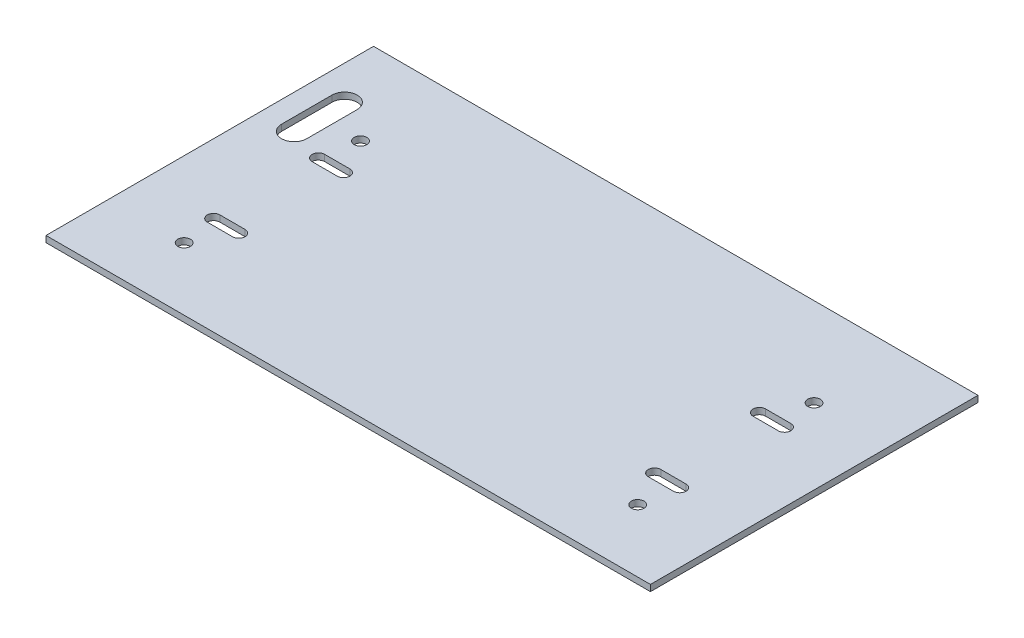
ISO-10303-21;
HEADER;
FILE_DESCRIPTION(('STEP AP214'),'2;1');
FILE_NAME('part.step','',(''),(''),'','','');
FILE_SCHEMA(('AUTOMOTIVE_DESIGN { 1 0 10303 214 1 1 1 1 }'));
ENDSEC;
DATA;
#1=APPLICATION_CONTEXT('core data for automotive mechanical design processes');
#2=APPLICATION_PROTOCOL_DEFINITION('international standard','automotive_design',2000,#1);
#3=PRODUCT_CONTEXT('',#1,'mechanical');
#4=PRODUCT('Part','Part','',(#3));
#5=PRODUCT_RELATED_PRODUCT_CATEGORY('part','',(#4));
#6=PRODUCT_DEFINITION_FORMATION('','',#4);
#7=PRODUCT_DEFINITION_CONTEXT('part definition',#1,'design');
#8=PRODUCT_DEFINITION('design','',#6,#7);
#9=PRODUCT_DEFINITION_SHAPE('','',#8);
#10=(LENGTH_UNIT() NAMED_UNIT(*) SI_UNIT(.MILLI.,.METRE.));
#11=(NAMED_UNIT(*) PLANE_ANGLE_UNIT() SI_UNIT($,.RADIAN.));
#12=(NAMED_UNIT(*) SI_UNIT($,.STERADIAN.) SOLID_ANGLE_UNIT());
#13=UNCERTAINTY_MEASURE_WITH_UNIT(LENGTH_MEASURE(1.E-05),#10,'distance_accuracy_value','');
#14=(GEOMETRIC_REPRESENTATION_CONTEXT(3) GLOBAL_UNCERTAINTY_ASSIGNED_CONTEXT((#13)) GLOBAL_UNIT_ASSIGNED_CONTEXT((#10,
#11,#12)) REPRESENTATION_CONTEXT('',''));
#15=CARTESIAN_POINT('',(0.,0.,0.));
#16=DIRECTION('',(0.,0.,1.));
#17=DIRECTION('',(1.,0.,0.));
#18=AXIS2_PLACEMENT_3D('',#15,#16,#17);
#19=CARTESIAN_POINT('',(0.,405.387122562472,-1.35788972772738E-13));
#20=DIRECTION('',(0.,-1.,0.));
#21=DIRECTION('',(0.,0.,-1.));
#22=AXIS2_PLACEMENT_3D('',#19,#20,#21);
#23=PLANE('',#22);
#24=DIRECTION('',(1.,0.,0.));
#25=VECTOR('',#24,1.);
#26=CARTESIAN_POINT('',(-877.346620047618,405.387122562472,1209.64459463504));
#27=LINE('',#26,#25);
#28=CARTESIAN_POINT('',(-877.346620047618,405.387122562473,1209.64459463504));
#29=VERTEX_POINT('',#28);
#30=CARTESIAN_POINT('',(-864.646620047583,405.387122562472,1209.64459463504));
#31=VERTEX_POINT('',#30);
#32=EDGE_CURVE('E260',#29,#31,#27,.T.);
#33=ORIENTED_EDGE('',*,*,#32,.F.);
#34=CARTESIAN_POINT('',(-877.346620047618,405.387122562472,1206.46959463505));
#35=DIRECTION('',(0.,1.,0.));
#36=DIRECTION('',(0.,0.,1.));
#37=AXIS2_PLACEMENT_3D('',#34,#35,#36);
#38=CIRCLE('',#37,3.17499999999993);
#39=CARTESIAN_POINT('',(-877.346620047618,405.387122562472,1203.29459463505));
#40=VERTEX_POINT('',#39);
#41=EDGE_CURVE('E53',#40,#29,#38,.T.);
#42=ORIENTED_EDGE('',*,*,#41,.F.);
#43=DIRECTION('',(-1.,0.,0.));
#44=VECTOR('',#43,1.);
#45=CARTESIAN_POINT('',(-877.346620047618,405.387122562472,1203.29459463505));
#46=LINE('',#45,#44);
#47=CARTESIAN_POINT('',(-864.646620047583,405.387122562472,1203.29459463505));
#48=VERTEX_POINT('',#47);
#49=EDGE_CURVE('E248',#48,#40,#46,.T.);
#50=ORIENTED_EDGE('',*,*,#49,.F.);
#51=CARTESIAN_POINT('',(-864.646620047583,405.387122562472,1206.46959463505));
#52=DIRECTION('',(0.,1.,0.));
#53=DIRECTION('',(0.,0.,1.));
#54=AXIS2_PLACEMENT_3D('',#51,#52,#53);
#55=CIRCLE('',#54,3.17499999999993);
#56=EDGE_CURVE('E251',#31,#48,#55,.T.);
#57=ORIENTED_EDGE('',*,*,#56,.F.);
#58=EDGE_LOOP('',(#33,#42,#50,#57));
#59=FACE_BOUND('',#58,.T.);
#60=DIRECTION('',(-1.,0.,0.));
#61=VECTOR('',#60,1.);
#62=CARTESIAN_POINT('',(-642.396620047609,405.387122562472,1150.46190980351));
#63=LINE('',#62,#61);
#64=CARTESIAN_POINT('',(-642.396620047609,405.387122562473,1150.46190980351));
#65=VERTEX_POINT('',#64);
#66=CARTESIAN_POINT('',(-655.096620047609,405.387122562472,1150.46190980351));
#67=VERTEX_POINT('',#66);
#68=EDGE_CURVE('E281',#65,#67,#63,.T.);
#69=ORIENTED_EDGE('',*,*,#68,.F.);
#70=CARTESIAN_POINT('',(-642.396620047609,405.387122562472,1153.63690980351));
#71=DIRECTION('',(0.,1.,0.));
#72=DIRECTION('',(0.,0.,-1.));
#73=AXIS2_PLACEMENT_3D('',#70,#71,#72);
#74=CIRCLE('',#73,3.17500000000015);
#75=CARTESIAN_POINT('',(-642.396620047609,405.387122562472,1156.81190980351));
#76=VERTEX_POINT('',#75);
#77=EDGE_CURVE('E65',#76,#65,#74,.T.);
#78=ORIENTED_EDGE('',*,*,#77,.F.);
#79=DIRECTION('',(1.,0.,0.));
#80=VECTOR('',#79,1.);
#81=CARTESIAN_POINT('',(-642.396620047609,405.387122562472,1156.81190980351));
#82=LINE('',#81,#80);
#83=CARTESIAN_POINT('',(-655.096620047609,405.387122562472,1156.81190980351));
#84=VERTEX_POINT('',#83);
#85=EDGE_CURVE('E279',#84,#76,#82,.T.);
#86=ORIENTED_EDGE('',*,*,#85,.F.);
#87=CARTESIAN_POINT('',(-655.096620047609,405.387122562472,1153.63690980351));
#88=DIRECTION('',(0.,1.,0.));
#89=DIRECTION('',(0.,0.,-1.));
#90=AXIS2_PLACEMENT_3D('',#87,#88,#89);
#91=CIRCLE('',#90,3.17500000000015);
#92=EDGE_CURVE('E282',#67,#84,#91,.T.);
#93=ORIENTED_EDGE('',*,*,#92,.F.);
#94=EDGE_LOOP('',(#69,#78,#86,#93));
#95=FACE_BOUND('',#94,.T.);
#96=DIRECTION('',(-1.,0.,0.));
#97=VECTOR('',#96,1.);
#98=CARTESIAN_POINT('',(-642.396620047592,405.387122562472,1203.29459463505));
#99=LINE('',#98,#97);
#100=CARTESIAN_POINT('',(-642.396620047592,405.387122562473,1203.29459463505));
#101=VERTEX_POINT('',#100);
#102=CARTESIAN_POINT('',(-655.096620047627,405.387122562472,1203.29459463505));
#103=VERTEX_POINT('',#102);
#104=EDGE_CURVE('E224',#101,#103,#99,.T.);
#105=ORIENTED_EDGE('',*,*,#104,.F.);
#106=CARTESIAN_POINT('',(-642.396620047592,405.387122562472,1206.46959463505));
#107=DIRECTION('',(0.,1.,0.));
#108=DIRECTION('',(0.,0.,-1.));
#109=AXIS2_PLACEMENT_3D('',#106,#107,#108);
#110=CIRCLE('',#109,3.17499999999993);
#111=CARTESIAN_POINT('',(-642.396620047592,405.387122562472,1209.64459463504));
#112=VERTEX_POINT('',#111);
#113=EDGE_CURVE('E201',#112,#101,#110,.T.);
#114=ORIENTED_EDGE('',*,*,#113,.F.);
#115=DIRECTION('',(1.,0.,0.));
#116=VECTOR('',#115,1.);
#117=CARTESIAN_POINT('',(-642.396620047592,405.387122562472,1209.64459463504));
#118=LINE('',#117,#116);
#119=CARTESIAN_POINT('',(-655.096620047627,405.387122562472,1209.64459463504));
#120=VERTEX_POINT('',#119);
#121=EDGE_CURVE('E213',#120,#112,#118,.T.);
#122=ORIENTED_EDGE('',*,*,#121,.F.);
#123=CARTESIAN_POINT('',(-655.096620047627,405.387122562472,1206.46959463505));
#124=DIRECTION('',(0.,1.,0.));
#125=DIRECTION('',(0.,0.,-1.));
#126=AXIS2_PLACEMENT_3D('',#123,#124,#125);
#127=CIRCLE('',#126,3.17499999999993);
#128=EDGE_CURVE('E217',#103,#120,#127,.T.);
#129=ORIENTED_EDGE('',*,*,#128,.F.);
#130=EDGE_LOOP('',(#105,#114,#122,#129));
#131=FACE_BOUND('',#130,.T.);
#132=DIRECTION('',(1.,0.,0.));
#133=VECTOR('',#132,1.);
#134=CARTESIAN_POINT('',(-877.346620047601,405.387122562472,1156.81190980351));
#135=LINE('',#134,#133);
#136=CARTESIAN_POINT('',(-877.346620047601,405.387122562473,1156.81190980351));
#137=VERTEX_POINT('',#136);
#138=CARTESIAN_POINT('',(-864.646620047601,405.387122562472,1156.81190980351));
#139=VERTEX_POINT('',#138);
#140=EDGE_CURVE('E314',#137,#139,#135,.T.);
#141=ORIENTED_EDGE('',*,*,#140,.F.);
#142=CARTESIAN_POINT('',(-877.346620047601,405.387122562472,1153.63690980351));
#143=DIRECTION('',(0.,1.,0.));
#144=DIRECTION('',(0.,0.,1.));
#145=AXIS2_PLACEMENT_3D('',#142,#143,#144);
#146=CIRCLE('',#145,3.17500000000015);
#147=CARTESIAN_POINT('',(-877.346620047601,405.387122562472,1150.46190980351));
#148=VERTEX_POINT('',#147);
#149=EDGE_CURVE('E261',#148,#137,#146,.T.);
#150=ORIENTED_EDGE('',*,*,#149,.F.);
#151=DIRECTION('',(-1.,0.,0.));
#152=VECTOR('',#151,1.);
#153=CARTESIAN_POINT('',(-877.346620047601,405.387122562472,1150.46190980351));
#154=LINE('',#153,#152);
#155=CARTESIAN_POINT('',(-864.646620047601,405.387122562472,1150.46190980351));
#156=VERTEX_POINT('',#155);
#157=EDGE_CURVE('E304',#156,#148,#154,.T.);
#158=ORIENTED_EDGE('',*,*,#157,.F.);
#159=CARTESIAN_POINT('',(-864.646620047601,405.387122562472,1153.63690980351));
#160=DIRECTION('',(0.,1.,0.));
#161=DIRECTION('',(0.,0.,1.));
#162=AXIS2_PLACEMENT_3D('',#159,#160,#161);
#163=CIRCLE('',#162,3.17500000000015);
#164=EDGE_CURVE('E320',#139,#156,#163,.T.);
#165=ORIENTED_EDGE('',*,*,#164,.F.);
#166=EDGE_LOOP('',(#141,#150,#158,#165));
#167=FACE_BOUND('',#166,.T.);
#168=DIRECTION('',(0.,0.,1.));
#169=VECTOR('',#168,1.);
#170=CARTESIAN_POINT('',(-901.407870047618,405.387122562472,1122.73915146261));
#171=LINE('',#170,#169);
#172=CARTESIAN_POINT('',(-901.407870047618,405.387122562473,1122.73915146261));
#173=VERTEX_POINT('',#172);
#174=CARTESIAN_POINT('',(-901.407870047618,405.387122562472,1148.13915146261));
#175=VERTEX_POINT('',#174);
#176=EDGE_CURVE('E347',#173,#175,#171,.T.);
#177=ORIENTED_EDGE('',*,*,#176,.F.);
#178=CARTESIAN_POINT('',(-895.057870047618,405.387122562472,1122.73915146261));
#179=DIRECTION('',(0.,1.,0.));
#180=DIRECTION('',(0.,0.,1.));
#181=AXIS2_PLACEMENT_3D('',#178,#179,#180);
#182=CIRCLE('',#181,6.34999999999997);
#183=CARTESIAN_POINT('',(-888.707870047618,405.387122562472,1122.73915146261));
#184=VERTEX_POINT('',#183);
#185=EDGE_CURVE('E322',#184,#173,#182,.T.);
#186=ORIENTED_EDGE('',*,*,#185,.F.);
#187=DIRECTION('',(0.,0.,-1.));
#188=VECTOR('',#187,1.);
#189=CARTESIAN_POINT('',(-888.707870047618,405.387122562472,1122.73915146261));
#190=LINE('',#189,#188);
#191=CARTESIAN_POINT('',(-888.707870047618,405.387122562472,1148.13915146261));
#192=VERTEX_POINT('',#191);
#193=EDGE_CURVE('E333',#192,#184,#190,.T.);
#194=ORIENTED_EDGE('',*,*,#193,.F.);
#195=CARTESIAN_POINT('',(-895.057870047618,405.387122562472,1148.13915146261));
#196=DIRECTION('',(0.,1.,0.));
#197=DIRECTION('',(0.,0.,1.));
#198=AXIS2_PLACEMENT_3D('',#195,#196,#197);
#199=CIRCLE('',#198,6.34999999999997);
#200=EDGE_CURVE('E349',#175,#192,#199,.T.);
#201=ORIENTED_EDGE('',*,*,#200,.F.);
#202=EDGE_LOOP('',(#177,#186,#194,#201));
#203=FACE_BOUND('',#202,.T.);
#204=DIRECTION('',(0.,0.,1.));
#205=VECTOR('',#204,1.);
#206=CARTESIAN_POINT('',(-912.202870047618,405.387122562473,1256.08915146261));
#207=LINE('',#206,#205);
#208=CARTESIAN_POINT('',(-912.202870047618,405.387122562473,1090.98915146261));
#209=VERTEX_POINT('',#208);
#210=CARTESIAN_POINT('',(-912.202870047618,405.387122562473,1256.08915146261));
#211=VERTEX_POINT('',#210);
#212=EDGE_CURVE('E390',#209,#211,#207,.T.);
#213=ORIENTED_EDGE('',*,*,#212,.T.);
#214=DIRECTION('',(1.,0.,0.));
#215=VECTOR('',#214,1.);
#216=CARTESIAN_POINT('',(-912.202870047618,405.387122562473,1256.08915146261));
#217=LINE('',#216,#215);
#218=CARTESIAN_POINT('',(-607.540370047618,405.387122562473,1256.08915146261));
#219=VERTEX_POINT('',#218);
#220=EDGE_CURVE('E388',#211,#219,#217,.T.);
#221=ORIENTED_EDGE('',*,*,#220,.T.);
#222=DIRECTION('',(0.,0.,-1.));
#223=VECTOR('',#222,1.);
#224=CARTESIAN_POINT('',(-607.540370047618,405.387122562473,1256.08915146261));
#225=LINE('',#224,#223);
#226=CARTESIAN_POINT('',(-607.540370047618,405.387122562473,1090.98915146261));
#227=VERTEX_POINT('',#226);
#228=EDGE_CURVE('E393',#219,#227,#225,.T.);
#229=ORIENTED_EDGE('',*,*,#228,.T.);
#230=DIRECTION('',(-1.,0.,0.));
#231=VECTOR('',#230,1.);
#232=CARTESIAN_POINT('',(-912.202870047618,405.387122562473,1090.98915146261));
#233=LINE('',#232,#231);
#234=EDGE_CURVE('E391',#227,#209,#233,.T.);
#235=ORIENTED_EDGE('',*,*,#234,.T.);
#236=EDGE_LOOP('',(#213,#221,#229,#235));
#237=FACE_BOUND('',#236,.T.);
#238=CARTESIAN_POINT('',(-874.171620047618,405.387122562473,1135.60325221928));
#239=DIRECTION('',(0.,1.,0.));
#240=DIRECTION('',(0.,0.,1.));
#241=AXIS2_PLACEMENT_3D('',#238,#239,#240);
#242=CIRCLE('',#241,3.17500000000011);
#243=CARTESIAN_POINT('',(-874.171620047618,405.387122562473,1138.77825221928));
#244=VERTEX_POINT('',#243);
#245=EDGE_CURVE('E381',#244,#244,#242,.T.);
#246=ORIENTED_EDGE('',*,*,#245,.F.);
#247=EDGE_LOOP('',(#246));
#248=FACE_BOUND('',#247,.T.);
#249=CARTESIAN_POINT('',(-645.571620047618,405.387122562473,1135.60325221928));
#250=DIRECTION('',(0.,1.,0.));
#251=DIRECTION('',(0.,0.,1.));
#252=AXIS2_PLACEMENT_3D('',#249,#250,#251);
#253=CIRCLE('',#252,3.17500000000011);
#254=CARTESIAN_POINT('',(-645.571620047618,405.387122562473,1138.77825221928));
#255=VERTEX_POINT('',#254);
#256=EDGE_CURVE('E374',#255,#255,#253,.T.);
#257=ORIENTED_EDGE('',*,*,#256,.F.);
#258=EDGE_LOOP('',(#257));
#259=FACE_BOUND('',#258,.T.);
#260=CARTESIAN_POINT('',(-645.571620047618,405.387122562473,1224.50325221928));
#261=DIRECTION('',(0.,1.,0.));
#262=DIRECTION('',(0.,0.,1.));
#263=AXIS2_PLACEMENT_3D('',#260,#261,#262);
#264=CIRCLE('',#263,3.17500000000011);
#265=CARTESIAN_POINT('',(-645.571620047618,405.387122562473,1227.67825221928));
#266=VERTEX_POINT('',#265);
#267=EDGE_CURVE('E369',#266,#266,#264,.T.);
#268=ORIENTED_EDGE('',*,*,#267,.F.);
#269=EDGE_LOOP('',(#268));
#270=FACE_BOUND('',#269,.T.);
#271=CARTESIAN_POINT('',(-874.171620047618,405.387122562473,1224.50325221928));
#272=DIRECTION('',(0.,1.,0.));
#273=DIRECTION('',(0.,0.,1.));
#274=AXIS2_PLACEMENT_3D('',#271,#272,#273);
#275=CIRCLE('',#274,3.17500000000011);
#276=CARTESIAN_POINT('',(-874.171620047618,405.387122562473,1227.67825221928));
#277=VERTEX_POINT('',#276);
#278=EDGE_CURVE('E361',#277,#277,#275,.T.);
#279=ORIENTED_EDGE('',*,*,#278,.F.);
#280=EDGE_LOOP('',(#279));
#281=FACE_BOUND('',#280,.T.);
#282=ADVANCED_FACE('F39',(#59,#95,#131,#167,#203,#237,#248,#259,#270,#281),#23,.F.);
#283=CARTESIAN_POINT('',(0.,402.212122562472,-1.3523475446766E-13));
#284=DIRECTION('',(0.,-1.,0.));
#285=DIRECTION('',(0.,0.,-1.));
#286=AXIS2_PLACEMENT_3D('',#283,#284,#285);
#287=PLANE('',#286);
#288=CARTESIAN_POINT('',(-877.346620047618,402.212122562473,1206.46959463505));
#289=DIRECTION('',(0.,1.,0.));
#290=DIRECTION('',(0.,0.,1.));
#291=AXIS2_PLACEMENT_3D('',#288,#289,#290);
#292=CIRCLE('',#291,3.17499999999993);
#293=CARTESIAN_POINT('',(-877.346620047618,402.212122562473,1203.29459463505));
#294=VERTEX_POINT('',#293);
#295=CARTESIAN_POINT('',(-877.346620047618,402.212122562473,1209.64459463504));
#296=VERTEX_POINT('',#295);
#297=EDGE_CURVE('E255',#294,#296,#292,.T.);
#298=ORIENTED_EDGE('',*,*,#297,.T.);
#299=DIRECTION('',(1.,0.,0.));
#300=VECTOR('',#299,1.);
#301=CARTESIAN_POINT('',(-877.346620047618,402.212122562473,1209.64459463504));
#302=LINE('',#301,#300);
#303=CARTESIAN_POINT('',(-864.646620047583,402.212122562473,1209.64459463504));
#304=VERTEX_POINT('',#303);
#305=EDGE_CURVE('E270',#296,#304,#302,.T.);
#306=ORIENTED_EDGE('',*,*,#305,.T.);
#307=CARTESIAN_POINT('',(-864.646620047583,402.212122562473,1206.46959463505));
#308=DIRECTION('',(0.,1.,0.));
#309=DIRECTION('',(0.,0.,1.));
#310=AXIS2_PLACEMENT_3D('',#307,#308,#309);
#311=CIRCLE('',#310,3.17499999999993);
#312=CARTESIAN_POINT('',(-864.646620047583,402.212122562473,1203.29459463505));
#313=VERTEX_POINT('',#312);
#314=EDGE_CURVE('E262',#304,#313,#311,.T.);
#315=ORIENTED_EDGE('',*,*,#314,.T.);
#316=DIRECTION('',(-1.,0.,0.));
#317=VECTOR('',#316,1.);
#318=CARTESIAN_POINT('',(-877.346620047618,402.212122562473,1203.29459463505));
#319=LINE('',#318,#317);
#320=EDGE_CURVE('E243',#313,#294,#319,.T.);
#321=ORIENTED_EDGE('',*,*,#320,.T.);
#322=EDGE_LOOP('',(#298,#306,#315,#321));
#323=FACE_BOUND('',#322,.T.);
#324=CARTESIAN_POINT('',(-642.396620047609,402.212122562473,1153.63690980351));
#325=DIRECTION('',(0.,1.,0.));
#326=DIRECTION('',(0.,0.,-1.));
#327=AXIS2_PLACEMENT_3D('',#324,#325,#326);
#328=CIRCLE('',#327,3.17500000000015);
#329=CARTESIAN_POINT('',(-642.396620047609,402.212122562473,1156.81190980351));
#330=VERTEX_POINT('',#329);
#331=CARTESIAN_POINT('',(-642.396620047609,402.212122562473,1150.46190980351));
#332=VERTEX_POINT('',#331);
#333=EDGE_CURVE('E285',#330,#332,#328,.T.);
#334=ORIENTED_EDGE('',*,*,#333,.T.);
#335=DIRECTION('',(-1.,0.,0.));
#336=VECTOR('',#335,1.);
#337=CARTESIAN_POINT('',(-642.396620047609,402.212122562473,1150.46190980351));
#338=LINE('',#337,#336);
#339=CARTESIAN_POINT('',(-655.096620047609,402.212122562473,1150.46190980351));
#340=VERTEX_POINT('',#339);
#341=EDGE_CURVE('E294',#332,#340,#338,.T.);
#342=ORIENTED_EDGE('',*,*,#341,.T.);
#343=CARTESIAN_POINT('',(-655.096620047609,402.212122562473,1153.63690980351));
#344=DIRECTION('',(0.,1.,0.));
#345=DIRECTION('',(0.,0.,-1.));
#346=AXIS2_PLACEMENT_3D('',#343,#344,#345);
#347=CIRCLE('',#346,3.17500000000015);
#348=CARTESIAN_POINT('',(-655.096620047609,402.212122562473,1156.81190980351));
#349=VERTEX_POINT('',#348);
#350=EDGE_CURVE('E292',#340,#349,#347,.T.);
#351=ORIENTED_EDGE('',*,*,#350,.T.);
#352=DIRECTION('',(1.,0.,0.));
#353=VECTOR('',#352,1.);
#354=CARTESIAN_POINT('',(-642.396620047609,402.212122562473,1156.81190980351));
#355=LINE('',#354,#353);
#356=EDGE_CURVE('E273',#349,#330,#355,.T.);
#357=ORIENTED_EDGE('',*,*,#356,.T.);
#358=EDGE_LOOP('',(#334,#342,#351,#357));
#359=FACE_BOUND('',#358,.T.);
#360=CARTESIAN_POINT('',(-642.396620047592,402.212122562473,1206.46959463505));
#361=DIRECTION('',(0.,1.,0.));
#362=DIRECTION('',(0.,0.,-1.));
#363=AXIS2_PLACEMENT_3D('',#360,#361,#362);
#364=CIRCLE('',#363,3.17499999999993);
#365=CARTESIAN_POINT('',(-642.396620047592,402.212122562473,1209.64459463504));
#366=VERTEX_POINT('',#365);
#367=CARTESIAN_POINT('',(-642.396620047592,402.212122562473,1203.29459463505));
#368=VERTEX_POINT('',#367);
#369=EDGE_CURVE('E206',#366,#368,#364,.T.);
#370=ORIENTED_EDGE('',*,*,#369,.T.);
#371=DIRECTION('',(-1.,0.,0.));
#372=VECTOR('',#371,1.);
#373=CARTESIAN_POINT('',(-642.396620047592,402.212122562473,1203.29459463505));
#374=LINE('',#373,#372);
#375=CARTESIAN_POINT('',(-655.096620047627,402.212122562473,1203.29459463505));
#376=VERTEX_POINT('',#375);
#377=EDGE_CURVE('E240',#368,#376,#374,.T.);
#378=ORIENTED_EDGE('',*,*,#377,.T.);
#379=CARTESIAN_POINT('',(-655.096620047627,402.212122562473,1206.46959463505));
#380=DIRECTION('',(0.,1.,0.));
#381=DIRECTION('',(0.,0.,-1.));
#382=AXIS2_PLACEMENT_3D('',#379,#380,#381);
#383=CIRCLE('',#382,3.17499999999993);
#384=CARTESIAN_POINT('',(-655.096620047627,402.212122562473,1209.64459463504));
#385=VERTEX_POINT('',#384);
#386=EDGE_CURVE('E234',#376,#385,#383,.T.);
#387=ORIENTED_EDGE('',*,*,#386,.T.);
#388=DIRECTION('',(1.,0.,0.));
#389=VECTOR('',#388,1.);
#390=CARTESIAN_POINT('',(-642.396620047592,402.212122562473,1209.64459463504));
#391=LINE('',#390,#389);
#392=EDGE_CURVE('E232',#385,#366,#391,.T.);
#393=ORIENTED_EDGE('',*,*,#392,.T.);
#394=EDGE_LOOP('',(#370,#378,#387,#393));
#395=FACE_BOUND('',#394,.T.);
#396=CARTESIAN_POINT('',(-877.346620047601,402.212122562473,1153.63690980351));
#397=DIRECTION('',(0.,1.,0.));
#398=DIRECTION('',(0.,0.,1.));
#399=AXIS2_PLACEMENT_3D('',#396,#397,#398);
#400=CIRCLE('',#399,3.17500000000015);
#401=CARTESIAN_POINT('',(-877.346620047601,402.212122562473,1150.46190980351));
#402=VERTEX_POINT('',#401);
#403=CARTESIAN_POINT('',(-877.346620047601,402.212122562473,1156.81190980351));
#404=VERTEX_POINT('',#403);
#405=EDGE_CURVE('E299',#402,#404,#400,.T.);
#406=ORIENTED_EDGE('',*,*,#405,.T.);
#407=DIRECTION('',(1.,0.,0.));
#408=VECTOR('',#407,1.);
#409=CARTESIAN_POINT('',(-877.346620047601,402.212122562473,1156.81190980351));
#410=LINE('',#409,#408);
#411=CARTESIAN_POINT('',(-864.646620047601,402.212122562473,1156.81190980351));
#412=VERTEX_POINT('',#411);
#413=EDGE_CURVE('E305',#404,#412,#410,.T.);
#414=ORIENTED_EDGE('',*,*,#413,.T.);
#415=CARTESIAN_POINT('',(-864.646620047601,402.212122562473,1153.63690980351));
#416=DIRECTION('',(0.,1.,0.));
#417=DIRECTION('',(0.,0.,1.));
#418=AXIS2_PLACEMENT_3D('',#415,#416,#417);
#419=CIRCLE('',#418,3.17500000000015);
#420=CARTESIAN_POINT('',(-864.646620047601,402.212122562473,1150.46190980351));
#421=VERTEX_POINT('',#420);
#422=EDGE_CURVE('E308',#412,#421,#419,.T.);
#423=ORIENTED_EDGE('',*,*,#422,.T.);
#424=DIRECTION('',(-1.,0.,0.));
#425=VECTOR('',#424,1.);
#426=CARTESIAN_POINT('',(-877.346620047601,402.212122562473,1150.46190980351));
#427=LINE('',#426,#425);
#428=EDGE_CURVE('E310',#421,#402,#427,.T.);
#429=ORIENTED_EDGE('',*,*,#428,.T.);
#430=EDGE_LOOP('',(#406,#414,#423,#429));
#431=FACE_BOUND('',#430,.T.);
#432=CARTESIAN_POINT('',(-895.057870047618,402.212122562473,1122.73915146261));
#433=DIRECTION('',(0.,1.,0.));
#434=DIRECTION('',(0.,0.,1.));
#435=AXIS2_PLACEMENT_3D('',#432,#433,#434);
#436=CIRCLE('',#435,6.34999999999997);
#437=CARTESIAN_POINT('',(-888.707870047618,402.212122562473,1122.73915146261));
#438=VERTEX_POINT('',#437);
#439=CARTESIAN_POINT('',(-901.407870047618,402.212122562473,1122.73915146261));
#440=VERTEX_POINT('',#439);
#441=EDGE_CURVE('E332',#438,#440,#436,.T.);
#442=ORIENTED_EDGE('',*,*,#441,.T.);
#443=DIRECTION('',(0.,0.,1.));
#444=VECTOR('',#443,1.);
#445=CARTESIAN_POINT('',(-901.407870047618,402.212122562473,1122.73915146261));
#446=LINE('',#445,#444);
#447=CARTESIAN_POINT('',(-901.407870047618,402.212122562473,1148.13915146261));
#448=VERTEX_POINT('',#447);
#449=EDGE_CURVE('E331',#440,#448,#446,.T.);
#450=ORIENTED_EDGE('',*,*,#449,.T.);
#451=CARTESIAN_POINT('',(-895.057870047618,402.212122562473,1148.13915146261));
#452=DIRECTION('',(0.,1.,0.));
#453=DIRECTION('',(0.,0.,1.));
#454=AXIS2_PLACEMENT_3D('',#451,#452,#453);
#455=CIRCLE('',#454,6.34999999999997);
#456=CARTESIAN_POINT('',(-888.707870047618,402.212122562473,1148.13915146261));
#457=VERTEX_POINT('',#456);
#458=EDGE_CURVE('E338',#448,#457,#455,.T.);
#459=ORIENTED_EDGE('',*,*,#458,.T.);
#460=DIRECTION('',(0.,0.,-1.));
#461=VECTOR('',#460,1.);
#462=CARTESIAN_POINT('',(-888.707870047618,402.212122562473,1122.73915146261));
#463=LINE('',#462,#461);
#464=EDGE_CURVE('E342',#457,#438,#463,.T.);
#465=ORIENTED_EDGE('',*,*,#464,.T.);
#466=EDGE_LOOP('',(#442,#450,#459,#465));
#467=FACE_BOUND('',#466,.T.);
#468=CARTESIAN_POINT('',(-645.571620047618,402.212122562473,1224.50325221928));
#469=DIRECTION('',(0.,1.,0.));
#470=DIRECTION('',(0.,0.,1.));
#471=AXIS2_PLACEMENT_3D('',#468,#469,#470);
#472=CIRCLE('',#471,3.17500000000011);
#473=CARTESIAN_POINT('',(-645.571620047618,402.212122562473,1227.67825221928));
#474=VERTEX_POINT('',#473);
#475=EDGE_CURVE('E368',#474,#474,#472,.T.);
#476=ORIENTED_EDGE('',*,*,#475,.T.);
#477=EDGE_LOOP('',(#476));
#478=FACE_BOUND('',#477,.T.);
#479=CARTESIAN_POINT('',(-874.171620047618,402.212122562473,1135.60325221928));
#480=DIRECTION('',(0.,1.,0.));
#481=DIRECTION('',(0.,0.,1.));
#482=AXIS2_PLACEMENT_3D('',#479,#480,#481);
#483=CIRCLE('',#482,3.17500000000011);
#484=CARTESIAN_POINT('',(-874.171620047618,402.212122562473,1138.77825221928));
#485=VERTEX_POINT('',#484);
#486=EDGE_CURVE('E378',#485,#485,#483,.T.);
#487=ORIENTED_EDGE('',*,*,#486,.T.);
#488=EDGE_LOOP('',(#487));
#489=FACE_BOUND('',#488,.T.);
#490=DIRECTION('',(0.,0.,1.));
#491=VECTOR('',#490,1.);
#492=CARTESIAN_POINT('',(-912.202870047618,402.212122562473,1256.08915146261));
#493=LINE('',#492,#491);
#494=CARTESIAN_POINT('',(-912.202870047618,402.212122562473,1090.98915146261));
#495=VERTEX_POINT('',#494);
#496=CARTESIAN_POINT('',(-912.202870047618,402.212122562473,1256.08915146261));
#497=VERTEX_POINT('',#496);
#498=EDGE_CURVE('E383',#495,#497,#493,.T.);
#499=ORIENTED_EDGE('',*,*,#498,.F.);
#500=DIRECTION('',(-1.,0.,0.));
#501=VECTOR('',#500,1.);
#502=CARTESIAN_POINT('',(-912.202870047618,402.212122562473,1090.98915146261));
#503=LINE('',#502,#501);
#504=CARTESIAN_POINT('',(-607.540370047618,402.212122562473,1090.98915146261));
#505=VERTEX_POINT('',#504);
#506=EDGE_CURVE('E392',#505,#495,#503,.T.);
#507=ORIENTED_EDGE('',*,*,#506,.F.);
#508=DIRECTION('',(0.,0.,-1.));
#509=VECTOR('',#508,1.);
#510=CARTESIAN_POINT('',(-607.540370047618,402.212122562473,1256.08915146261));
#511=LINE('',#510,#509);
#512=CARTESIAN_POINT('',(-607.540370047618,402.212122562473,1256.08915146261));
#513=VERTEX_POINT('',#512);
#514=EDGE_CURVE('E405',#513,#505,#511,.T.);
#515=ORIENTED_EDGE('',*,*,#514,.F.);
#516=DIRECTION('',(1.,0.,0.));
#517=VECTOR('',#516,1.);
#518=CARTESIAN_POINT('',(-912.202870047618,402.212122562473,1256.08915146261));
#519=LINE('',#518,#517);
#520=EDGE_CURVE('E398',#497,#513,#519,.T.);
#521=ORIENTED_EDGE('',*,*,#520,.F.);
#522=EDGE_LOOP('',(#499,#507,#515,#521));
#523=FACE_BOUND('',#522,.T.);
#524=CARTESIAN_POINT('',(-645.571620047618,402.212122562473,1135.60325221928));
#525=DIRECTION('',(0.,1.,0.));
#526=DIRECTION('',(0.,0.,1.));
#527=AXIS2_PLACEMENT_3D('',#524,#525,#526);
#528=CIRCLE('',#527,3.17500000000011);
#529=CARTESIAN_POINT('',(-645.571620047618,402.212122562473,1138.77825221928));
#530=VERTEX_POINT('',#529);
#531=EDGE_CURVE('E375',#530,#530,#528,.T.);
#532=ORIENTED_EDGE('',*,*,#531,.T.);
#533=EDGE_LOOP('',(#532));
#534=FACE_BOUND('',#533,.T.);
#535=CARTESIAN_POINT('',(-874.171620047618,402.212122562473,1224.50325221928));
#536=DIRECTION('',(0.,1.,0.));
#537=DIRECTION('',(0.,0.,1.));
#538=AXIS2_PLACEMENT_3D('',#535,#536,#537);
#539=CIRCLE('',#538,3.17500000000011);
#540=CARTESIAN_POINT('',(-874.171620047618,402.212122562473,1227.67825221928));
#541=VERTEX_POINT('',#540);
#542=EDGE_CURVE('E357',#541,#541,#539,.T.);
#543=ORIENTED_EDGE('',*,*,#542,.T.);
#544=EDGE_LOOP('',(#543));
#545=FACE_BOUND('',#544,.T.);
#546=ADVANCED_FACE('F419',(#323,#359,#395,#431,#467,#478,#489,#523,#534,#545),#287,.T.);
#547=CARTESIAN_POINT('',(-912.202870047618,405.387122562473,1256.08915146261));
#548=DIRECTION('',(1.,0.,0.));
#549=DIRECTION('',(0.,1.,0.));
#550=AXIS2_PLACEMENT_3D('',#547,#548,#549);
#551=PLANE('',#550);
#552=ORIENTED_EDGE('',*,*,#498,.T.);
#553=DIRECTION('',(0.,-1.,0.));
#554=VECTOR('',#553,1.);
#555=CARTESIAN_POINT('',(-912.202870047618,405.387122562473,1256.08915146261));
#556=LINE('',#555,#554);
#557=EDGE_CURVE('E11',#211,#497,#556,.T.);
#558=ORIENTED_EDGE('',*,*,#557,.F.);
#559=ORIENTED_EDGE('',*,*,#212,.F.);
#560=DIRECTION('',(0.,-1.,0.));
#561=VECTOR('',#560,1.);
#562=CARTESIAN_POINT('',(-912.202870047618,405.387122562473,1090.98915146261));
#563=LINE('',#562,#561);
#564=EDGE_CURVE('E400',#209,#495,#563,.T.);
#565=ORIENTED_EDGE('',*,*,#564,.T.);
#566=EDGE_LOOP('',(#552,#558,#559,#565));
#567=FACE_BOUND('',#566,.T.);
#568=ADVANCED_FACE('F41',(#567),#551,.F.);
#569=CARTESIAN_POINT('',(-912.202870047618,405.387122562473,1256.08915146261));
#570=DIRECTION('',(0.,0.,-1.));
#571=DIRECTION('',(0.,1.,0.));
#572=AXIS2_PLACEMENT_3D('',#569,#570,#571);
#573=PLANE('',#572);
#574=ORIENTED_EDGE('',*,*,#520,.T.);
#575=DIRECTION('',(0.,-1.,0.));
#576=VECTOR('',#575,1.);
#577=CARTESIAN_POINT('',(-607.540370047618,405.387122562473,1256.08915146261));
#578=LINE('',#577,#576);
#579=EDGE_CURVE('E50',#219,#513,#578,.T.);
#580=ORIENTED_EDGE('',*,*,#579,.F.);
#581=ORIENTED_EDGE('',*,*,#220,.F.);
#582=ORIENTED_EDGE('',*,*,#557,.T.);
#583=EDGE_LOOP('',(#574,#580,#581,#582));
#584=FACE_BOUND('',#583,.T.);
#585=ADVANCED_FACE('F431',(#584),#573,.F.);
#586=CARTESIAN_POINT('',(-607.540370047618,405.387122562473,1256.08915146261));
#587=DIRECTION('',(-1.,0.,0.));
#588=DIRECTION('',(0.,0.,1.));
#589=AXIS2_PLACEMENT_3D('',#586,#587,#588);
#590=PLANE('',#589);
#591=ORIENTED_EDGE('',*,*,#514,.T.);
#592=DIRECTION('',(0.,-1.,0.));
#593=VECTOR('',#592,1.);
#594=CARTESIAN_POINT('',(-607.540370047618,405.387122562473,1090.98915146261));
#595=LINE('',#594,#593);
#596=EDGE_CURVE('E410',#227,#505,#595,.T.);
#597=ORIENTED_EDGE('',*,*,#596,.F.);
#598=ORIENTED_EDGE('',*,*,#228,.F.);
#599=ORIENTED_EDGE('',*,*,#579,.T.);
#600=EDGE_LOOP('',(#591,#597,#598,#599));
#601=FACE_BOUND('',#600,.T.);
#602=ADVANCED_FACE('F411',(#601),#590,.F.);
#603=CARTESIAN_POINT('',(-912.202870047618,405.387122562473,1090.98915146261));
#604=DIRECTION('',(0.,0.,1.));
#605=DIRECTION('',(0.,-1.,0.));
#606=AXIS2_PLACEMENT_3D('',#603,#604,#605);
#607=PLANE('',#606);
#608=ORIENTED_EDGE('',*,*,#506,.T.);
#609=ORIENTED_EDGE('',*,*,#564,.F.);
#610=ORIENTED_EDGE('',*,*,#234,.F.);
#611=ORIENTED_EDGE('',*,*,#596,.T.);
#612=EDGE_LOOP('',(#608,#609,#610,#611));
#613=FACE_BOUND('',#612,.T.);
#614=ADVANCED_FACE('F424',(#613),#607,.F.);
#615=CARTESIAN_POINT('',(-874.171620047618,405.387122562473,1135.60325221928));
#616=DIRECTION('',(0.,-1.,0.));
#617=DIRECTION('',(0.,0.,-1.));
#618=AXIS2_PLACEMENT_3D('',#615,#616,#617);
#619=CYLINDRICAL_SURFACE('',#618,3.17500000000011);
#620=ORIENTED_EDGE('',*,*,#245,.T.);
#621=EDGE_LOOP('',(#620));
#622=FACE_BOUND('',#621,.T.);
#623=ORIENTED_EDGE('',*,*,#486,.F.);
#624=EDGE_LOOP('',(#623));
#625=FACE_BOUND('',#624,.T.);
#626=ADVANCED_FACE('F446',(#622,#625),#619,.F.);
#627=CARTESIAN_POINT('',(-645.571620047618,405.387122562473,1135.60325221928));
#628=DIRECTION('',(0.,-1.,0.));
#629=DIRECTION('',(0.,0.,-1.));
#630=AXIS2_PLACEMENT_3D('',#627,#628,#629);
#631=CYLINDRICAL_SURFACE('',#630,3.17500000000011);
#632=ORIENTED_EDGE('',*,*,#256,.T.);
#633=EDGE_LOOP('',(#632));
#634=FACE_BOUND('',#633,.T.);
#635=ORIENTED_EDGE('',*,*,#531,.F.);
#636=EDGE_LOOP('',(#635));
#637=FACE_BOUND('',#636,.T.);
#638=ADVANCED_FACE('F460',(#634,#637),#631,.F.);
#639=CARTESIAN_POINT('',(-645.571620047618,405.387122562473,1224.50325221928));
#640=DIRECTION('',(0.,-1.,0.));
#641=DIRECTION('',(0.,0.,-1.));
#642=AXIS2_PLACEMENT_3D('',#639,#640,#641);
#643=CYLINDRICAL_SURFACE('',#642,3.17500000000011);
#644=ORIENTED_EDGE('',*,*,#267,.T.);
#645=EDGE_LOOP('',(#644));
#646=FACE_BOUND('',#645,.T.);
#647=ORIENTED_EDGE('',*,*,#475,.F.);
#648=EDGE_LOOP('',(#647));
#649=FACE_BOUND('',#648,.T.);
#650=ADVANCED_FACE('F465',(#646,#649),#643,.F.);
#651=CARTESIAN_POINT('',(-874.171620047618,405.387122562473,1224.50325221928));
#652=DIRECTION('',(0.,-1.,0.));
#653=DIRECTION('',(0.,0.,-1.));
#654=AXIS2_PLACEMENT_3D('',#651,#652,#653);
#655=CYLINDRICAL_SURFACE('',#654,3.17500000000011);
#656=ORIENTED_EDGE('',*,*,#278,.T.);
#657=EDGE_LOOP('',(#656));
#658=FACE_BOUND('',#657,.T.);
#659=ORIENTED_EDGE('',*,*,#542,.F.);
#660=EDGE_LOOP('',(#659));
#661=FACE_BOUND('',#660,.T.);
#662=ADVANCED_FACE('F474',(#658,#661),#655,.F.);
#663=CARTESIAN_POINT('',(-895.057870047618,402.212122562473,1122.73915146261));
#664=DIRECTION('',(0.,1.,0.));
#665=DIRECTION('',(0.,0.,1.));
#666=AXIS2_PLACEMENT_3D('',#663,#664,#665);
#667=CYLINDRICAL_SURFACE('',#666,6.34999999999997);
#668=ORIENTED_EDGE('',*,*,#185,.T.);
#669=DIRECTION('',(0.,1.,0.));
#670=VECTOR('',#669,1.);
#671=CARTESIAN_POINT('',(-901.407870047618,402.212122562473,1122.73915146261));
#672=LINE('',#671,#670);
#673=EDGE_CURVE('E341',#440,#173,#672,.T.);
#674=ORIENTED_EDGE('',*,*,#673,.F.);
#675=ORIENTED_EDGE('',*,*,#441,.F.);
#676=DIRECTION('',(0.,1.,0.));
#677=VECTOR('',#676,1.);
#678=CARTESIAN_POINT('',(-888.707870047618,402.212122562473,1122.73915146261));
#679=LINE('',#678,#677);
#680=EDGE_CURVE('E354',#438,#184,#679,.T.);
#681=ORIENTED_EDGE('',*,*,#680,.T.);
#682=EDGE_LOOP('',(#668,#674,#675,#681));
#683=FACE_BOUND('',#682,.T.);
#684=ADVANCED_FACE('F476',(#683),#667,.F.);
#685=CARTESIAN_POINT('',(-888.707870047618,402.212122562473,1122.73915146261));
#686=DIRECTION('',(1.,0.,0.));
#687=DIRECTION('',(0.,0.,-1.));
#688=AXIS2_PLACEMENT_3D('',#685,#686,#687);
#689=PLANE('',#688);
#690=ORIENTED_EDGE('',*,*,#193,.T.);
#691=ORIENTED_EDGE('',*,*,#680,.F.);
#692=ORIENTED_EDGE('',*,*,#464,.F.);
#693=DIRECTION('',(0.,1.,0.));
#694=VECTOR('',#693,1.);
#695=CARTESIAN_POINT('',(-888.707870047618,402.212122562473,1148.13915146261));
#696=LINE('',#695,#694);
#697=EDGE_CURVE('E360',#457,#192,#696,.T.);
#698=ORIENTED_EDGE('',*,*,#697,.T.);
#699=EDGE_LOOP('',(#690,#691,#692,#698));
#700=FACE_BOUND('',#699,.T.);
#701=ADVANCED_FACE('F486',(#700),#689,.F.);
#702=CARTESIAN_POINT('',(-895.057870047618,402.212122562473,1148.13915146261));
#703=DIRECTION('',(0.,1.,0.));
#704=DIRECTION('',(0.,0.,1.));
#705=AXIS2_PLACEMENT_3D('',#702,#703,#704);
#706=CYLINDRICAL_SURFACE('',#705,6.34999999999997);
#707=ORIENTED_EDGE('',*,*,#200,.T.);
#708=ORIENTED_EDGE('',*,*,#697,.F.);
#709=ORIENTED_EDGE('',*,*,#458,.F.);
#710=DIRECTION('',(0.,1.,0.));
#711=VECTOR('',#710,1.);
#712=CARTESIAN_POINT('',(-901.407870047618,402.212122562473,1148.13915146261));
#713=LINE('',#712,#711);
#714=EDGE_CURVE('E356',#448,#175,#713,.T.);
#715=ORIENTED_EDGE('',*,*,#714,.T.);
#716=EDGE_LOOP('',(#707,#708,#709,#715));
#717=FACE_BOUND('',#716,.T.);
#718=ADVANCED_FACE('F494',(#717),#706,.F.);
#719=CARTESIAN_POINT('',(-901.407870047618,402.212122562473,1122.73915146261));
#720=DIRECTION('',(-1.,0.,0.));
#721=DIRECTION('',(0.,0.,1.));
#722=AXIS2_PLACEMENT_3D('',#719,#720,#721);
#723=PLANE('',#722);
#724=ORIENTED_EDGE('',*,*,#176,.T.);
#725=ORIENTED_EDGE('',*,*,#714,.F.);
#726=ORIENTED_EDGE('',*,*,#449,.F.);
#727=ORIENTED_EDGE('',*,*,#673,.T.);
#728=EDGE_LOOP('',(#724,#725,#726,#727));
#729=FACE_BOUND('',#728,.T.);
#730=ADVANCED_FACE('F495',(#729),#723,.F.);
#731=CARTESIAN_POINT('',(-877.346620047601,402.212122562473,1153.63690980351));
#732=DIRECTION('',(0.,1.,0.));
#733=DIRECTION('',(0.,0.,1.));
#734=AXIS2_PLACEMENT_3D('',#731,#732,#733);
#735=CYLINDRICAL_SURFACE('',#734,3.17500000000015);
#736=ORIENTED_EDGE('',*,*,#149,.T.);
#737=DIRECTION('',(0.,1.,0.));
#738=VECTOR('',#737,1.);
#739=CARTESIAN_POINT('',(-877.346620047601,402.212122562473,1156.81190980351));
#740=LINE('',#739,#738);
#741=EDGE_CURVE('E315',#404,#137,#740,.T.);
#742=ORIENTED_EDGE('',*,*,#741,.F.);
#743=ORIENTED_EDGE('',*,*,#405,.F.);
#744=DIRECTION('',(0.,1.,0.));
#745=VECTOR('',#744,1.);
#746=CARTESIAN_POINT('',(-877.346620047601,402.212122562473,1150.46190980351));
#747=LINE('',#746,#745);
#748=EDGE_CURVE('E325',#402,#148,#747,.T.);
#749=ORIENTED_EDGE('',*,*,#748,.T.);
#750=EDGE_LOOP('',(#736,#742,#743,#749));
#751=FACE_BOUND('',#750,.T.);
#752=ADVANCED_FACE('F493',(#751),#735,.F.);
#753=CARTESIAN_POINT('',(-877.346620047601,402.212122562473,1150.46190980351));
#754=DIRECTION('',(0.,0.,-1.));
#755=DIRECTION('',(-1.,0.,0.));
#756=AXIS2_PLACEMENT_3D('',#753,#754,#755);
#757=PLANE('',#756);
#758=ORIENTED_EDGE('',*,*,#157,.T.);
#759=ORIENTED_EDGE('',*,*,#748,.F.);
#760=ORIENTED_EDGE('',*,*,#428,.F.);
#761=DIRECTION('',(0.,1.,0.));
#762=VECTOR('',#761,1.);
#763=CARTESIAN_POINT('',(-864.646620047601,402.212122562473,1150.46190980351));
#764=LINE('',#763,#762);
#765=EDGE_CURVE('E324',#421,#156,#764,.T.);
#766=ORIENTED_EDGE('',*,*,#765,.T.);
#767=EDGE_LOOP('',(#758,#759,#760,#766));
#768=FACE_BOUND('',#767,.T.);
#769=ADVANCED_FACE('F501',(#768),#757,.F.);
#770=CARTESIAN_POINT('',(-864.646620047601,402.212122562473,1153.63690980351));
#771=DIRECTION('',(0.,1.,0.));
#772=DIRECTION('',(0.,0.,1.));
#773=AXIS2_PLACEMENT_3D('',#770,#771,#772);
#774=CYLINDRICAL_SURFACE('',#773,3.17500000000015);
#775=ORIENTED_EDGE('',*,*,#164,.T.);
#776=ORIENTED_EDGE('',*,*,#765,.F.);
#777=ORIENTED_EDGE('',*,*,#422,.F.);
#778=DIRECTION('',(0.,1.,0.));
#779=VECTOR('',#778,1.);
#780=CARTESIAN_POINT('',(-864.646620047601,402.212122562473,1156.81190980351));
#781=LINE('',#780,#779);
#782=EDGE_CURVE('E330',#412,#139,#781,.T.);
#783=ORIENTED_EDGE('',*,*,#782,.T.);
#784=EDGE_LOOP('',(#775,#776,#777,#783));
#785=FACE_BOUND('',#784,.T.);
#786=ADVANCED_FACE('F508',(#785),#774,.F.);
#787=CARTESIAN_POINT('',(-877.346620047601,402.212122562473,1156.81190980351));
#788=DIRECTION('',(0.,0.,1.));
#789=DIRECTION('',(1.,0.,0.));
#790=AXIS2_PLACEMENT_3D('',#787,#788,#789);
#791=PLANE('',#790);
#792=ORIENTED_EDGE('',*,*,#140,.T.);
#793=ORIENTED_EDGE('',*,*,#782,.F.);
#794=ORIENTED_EDGE('',*,*,#413,.F.);
#795=ORIENTED_EDGE('',*,*,#741,.T.);
#796=EDGE_LOOP('',(#792,#793,#794,#795));
#797=FACE_BOUND('',#796,.T.);
#798=ADVANCED_FACE('F510',(#797),#791,.F.);
#799=CARTESIAN_POINT('',(-642.396620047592,402.212122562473,1206.46959463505));
#800=DIRECTION('',(0.,1.,0.));
#801=DIRECTION('',(0.,0.,1.));
#802=AXIS2_PLACEMENT_3D('',#799,#800,#801);
#803=CYLINDRICAL_SURFACE('',#802,3.17499999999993);
#804=ORIENTED_EDGE('',*,*,#113,.T.);
#805=DIRECTION('',(0.,1.,0.));
#806=VECTOR('',#805,1.);
#807=CARTESIAN_POINT('',(-642.396620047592,402.212122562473,1203.29459463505));
#808=LINE('',#807,#806);
#809=EDGE_CURVE('E231',#368,#101,#808,.T.);
#810=ORIENTED_EDGE('',*,*,#809,.F.);
#811=ORIENTED_EDGE('',*,*,#369,.F.);
#812=DIRECTION('',(0.,1.,0.));
#813=VECTOR('',#812,1.);
#814=CARTESIAN_POINT('',(-642.396620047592,402.212122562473,1209.64459463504));
#815=LINE('',#814,#813);
#816=EDGE_CURVE('E200',#366,#112,#815,.T.);
#817=ORIENTED_EDGE('',*,*,#816,.T.);
#818=EDGE_LOOP('',(#804,#810,#811,#817));
#819=FACE_BOUND('',#818,.T.);
#820=ADVANCED_FACE('F203',(#819),#803,.F.);
#821=CARTESIAN_POINT('',(-642.396620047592,402.212122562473,1209.64459463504));
#822=DIRECTION('',(0.,0.,1.));
#823=DIRECTION('',(1.,0.,0.));
#824=AXIS2_PLACEMENT_3D('',#821,#822,#823);
#825=PLANE('',#824);
#826=ORIENTED_EDGE('',*,*,#121,.T.);
#827=ORIENTED_EDGE('',*,*,#816,.F.);
#828=ORIENTED_EDGE('',*,*,#392,.F.);
#829=DIRECTION('',(0.,1.,0.));
#830=VECTOR('',#829,1.);
#831=CARTESIAN_POINT('',(-655.096620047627,402.212122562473,1209.64459463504));
#832=LINE('',#831,#830);
#833=EDGE_CURVE('E209',#385,#120,#832,.T.);
#834=ORIENTED_EDGE('',*,*,#833,.T.);
#835=EDGE_LOOP('',(#826,#827,#828,#834));
#836=FACE_BOUND('',#835,.T.);
#837=ADVANCED_FACE('F212',(#836),#825,.F.);
#838=CARTESIAN_POINT('',(-655.096620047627,402.212122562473,1206.46959463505));
#839=DIRECTION('',(0.,1.,0.));
#840=DIRECTION('',(0.,0.,1.));
#841=AXIS2_PLACEMENT_3D('',#838,#839,#840);
#842=CYLINDRICAL_SURFACE('',#841,3.17499999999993);
#843=ORIENTED_EDGE('',*,*,#128,.T.);
#844=ORIENTED_EDGE('',*,*,#833,.F.);
#845=ORIENTED_EDGE('',*,*,#386,.F.);
#846=DIRECTION('',(0.,1.,0.));
#847=VECTOR('',#846,1.);
#848=CARTESIAN_POINT('',(-655.096620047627,402.212122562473,1203.29459463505));
#849=LINE('',#848,#847);
#850=EDGE_CURVE('E732',#376,#103,#849,.T.);
#851=ORIENTED_EDGE('',*,*,#850,.T.);
#852=EDGE_LOOP('',(#843,#844,#845,#851));
#853=FACE_BOUND('',#852,.T.);
#854=ADVANCED_FACE('F552',(#853),#842,.F.);
#855=CARTESIAN_POINT('',(-642.396620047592,402.212122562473,1203.29459463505));
#856=DIRECTION('',(0.,0.,-1.));
#857=DIRECTION('',(-1.,0.,0.));
#858=AXIS2_PLACEMENT_3D('',#855,#856,#857);
#859=PLANE('',#858);
#860=ORIENTED_EDGE('',*,*,#104,.T.);
#861=ORIENTED_EDGE('',*,*,#850,.F.);
#862=ORIENTED_EDGE('',*,*,#377,.F.);
#863=ORIENTED_EDGE('',*,*,#809,.T.);
#864=EDGE_LOOP('',(#860,#861,#862,#863));
#865=FACE_BOUND('',#864,.T.);
#866=ADVANCED_FACE('F534',(#865),#859,.F.);
#867=CARTESIAN_POINT('',(-642.396620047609,402.212122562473,1153.63690980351));
#868=DIRECTION('',(0.,1.,0.));
#869=DIRECTION('',(0.,0.,1.));
#870=AXIS2_PLACEMENT_3D('',#867,#868,#869);
#871=CYLINDRICAL_SURFACE('',#870,3.17500000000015);
#872=ORIENTED_EDGE('',*,*,#77,.T.);
#873=DIRECTION('',(0.,1.,0.));
#874=VECTOR('',#873,1.);
#875=CARTESIAN_POINT('',(-642.396620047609,402.212122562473,1150.46190980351));
#876=LINE('',#875,#874);
#877=EDGE_CURVE('E275',#332,#65,#876,.T.);
#878=ORIENTED_EDGE('',*,*,#877,.F.);
#879=ORIENTED_EDGE('',*,*,#333,.F.);
#880=DIRECTION('',(0.,1.,0.));
#881=VECTOR('',#880,1.);
#882=CARTESIAN_POINT('',(-642.396620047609,402.212122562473,1156.81190980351));
#883=LINE('',#882,#881);
#884=EDGE_CURVE('E221',#330,#76,#883,.T.);
#885=ORIENTED_EDGE('',*,*,#884,.T.);
#886=EDGE_LOOP('',(#872,#878,#879,#885));
#887=FACE_BOUND('',#886,.T.);
#888=ADVANCED_FACE('F525',(#887),#871,.F.);
#889=CARTESIAN_POINT('',(-642.396620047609,402.212122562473,1156.81190980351));
#890=DIRECTION('',(0.,0.,1.));
#891=DIRECTION('',(1.,0.,0.));
#892=AXIS2_PLACEMENT_3D('',#889,#890,#891);
#893=PLANE('',#892);
#894=ORIENTED_EDGE('',*,*,#85,.T.);
#895=ORIENTED_EDGE('',*,*,#884,.F.);
#896=ORIENTED_EDGE('',*,*,#356,.F.);
#897=DIRECTION('',(0.,1.,0.));
#898=VECTOR('',#897,1.);
#899=CARTESIAN_POINT('',(-655.096620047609,402.212122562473,1156.81190980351));
#900=LINE('',#899,#898);
#901=EDGE_CURVE('E227',#349,#84,#900,.T.);
#902=ORIENTED_EDGE('',*,*,#901,.T.);
#903=EDGE_LOOP('',(#894,#895,#896,#902));
#904=FACE_BOUND('',#903,.T.);
#905=ADVANCED_FACE('F518',(#904),#893,.F.);
#906=CARTESIAN_POINT('',(-655.096620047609,402.212122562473,1153.63690980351));
#907=DIRECTION('',(0.,1.,0.));
#908=DIRECTION('',(0.,0.,1.));
#909=AXIS2_PLACEMENT_3D('',#906,#907,#908);
#910=CYLINDRICAL_SURFACE('',#909,3.17500000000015);
#911=ORIENTED_EDGE('',*,*,#92,.T.);
#912=ORIENTED_EDGE('',*,*,#901,.F.);
#913=ORIENTED_EDGE('',*,*,#350,.F.);
#914=DIRECTION('',(0.,1.,0.));
#915=VECTOR('',#914,1.);
#916=CARTESIAN_POINT('',(-655.096620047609,402.212122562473,1150.46190980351));
#917=LINE('',#916,#915);
#918=EDGE_CURVE('E274',#340,#67,#917,.T.);
#919=ORIENTED_EDGE('',*,*,#918,.T.);
#920=EDGE_LOOP('',(#911,#912,#913,#919));
#921=FACE_BOUND('',#920,.T.);
#922=ADVANCED_FACE('F522',(#921),#910,.F.);
#923=CARTESIAN_POINT('',(-642.396620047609,402.212122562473,1150.46190980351));
#924=DIRECTION('',(0.,0.,-1.));
#925=DIRECTION('',(-1.,0.,0.));
#926=AXIS2_PLACEMENT_3D('',#923,#924,#925);
#927=PLANE('',#926);
#928=ORIENTED_EDGE('',*,*,#68,.T.);
#929=ORIENTED_EDGE('',*,*,#918,.F.);
#930=ORIENTED_EDGE('',*,*,#341,.F.);
#931=ORIENTED_EDGE('',*,*,#877,.T.);
#932=EDGE_LOOP('',(#928,#929,#930,#931));
#933=FACE_BOUND('',#932,.T.);
#934=ADVANCED_FACE('F528',(#933),#927,.F.);
#935=CARTESIAN_POINT('',(-877.346620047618,402.212122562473,1206.46959463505));
#936=DIRECTION('',(0.,1.,0.));
#937=DIRECTION('',(0.,0.,1.));
#938=AXIS2_PLACEMENT_3D('',#935,#936,#937);
#939=CYLINDRICAL_SURFACE('',#938,3.17499999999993);
#940=ORIENTED_EDGE('',*,*,#41,.T.);
#941=DIRECTION('',(0.,1.,0.));
#942=VECTOR('',#941,1.);
#943=CARTESIAN_POINT('',(-877.346620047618,402.212122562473,1209.64459463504));
#944=LINE('',#943,#942);
#945=EDGE_CURVE('E242',#296,#29,#944,.T.);
#946=ORIENTED_EDGE('',*,*,#945,.F.);
#947=ORIENTED_EDGE('',*,*,#297,.F.);
#948=DIRECTION('',(0.,1.,0.));
#949=VECTOR('',#948,1.);
#950=CARTESIAN_POINT('',(-877.346620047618,402.212122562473,1203.29459463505));
#951=LINE('',#950,#949);
#952=EDGE_CURVE('E249',#294,#40,#951,.T.);
#953=ORIENTED_EDGE('',*,*,#952,.T.);
#954=EDGE_LOOP('',(#940,#946,#947,#953));
#955=FACE_BOUND('',#954,.T.);
#956=ADVANCED_FACE('F529',(#955),#939,.F.);
#957=CARTESIAN_POINT('',(-877.346620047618,402.212122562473,1203.29459463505));
#958=DIRECTION('',(0.,0.,-1.));
#959=DIRECTION('',(-1.,0.,0.));
#960=AXIS2_PLACEMENT_3D('',#957,#958,#959);
#961=PLANE('',#960);
#962=ORIENTED_EDGE('',*,*,#49,.T.);
#963=ORIENTED_EDGE('',*,*,#952,.F.);
#964=ORIENTED_EDGE('',*,*,#320,.F.);
#965=DIRECTION('',(0.,1.,0.));
#966=VECTOR('',#965,1.);
#967=CARTESIAN_POINT('',(-864.646620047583,402.212122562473,1203.29459463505));
#968=LINE('',#967,#966);
#969=EDGE_CURVE('E247',#313,#48,#968,.T.);
#970=ORIENTED_EDGE('',*,*,#969,.T.);
#971=EDGE_LOOP('',(#962,#963,#964,#970));
#972=FACE_BOUND('',#971,.T.);
#973=ADVANCED_FACE('F532',(#972),#961,.F.);
#974=CARTESIAN_POINT('',(-864.646620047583,402.212122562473,1206.46959463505));
#975=DIRECTION('',(0.,1.,0.));
#976=DIRECTION('',(0.,0.,1.));
#977=AXIS2_PLACEMENT_3D('',#974,#975,#976);
#978=CYLINDRICAL_SURFACE('',#977,3.17499999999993);
#979=ORIENTED_EDGE('',*,*,#56,.T.);
#980=ORIENTED_EDGE('',*,*,#969,.F.);
#981=ORIENTED_EDGE('',*,*,#314,.F.);
#982=DIRECTION('',(0.,1.,0.));
#983=VECTOR('',#982,1.);
#984=CARTESIAN_POINT('',(-864.646620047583,402.212122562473,1209.64459463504));
#985=LINE('',#984,#983);
#986=EDGE_CURVE('E244',#304,#31,#985,.T.);
#987=ORIENTED_EDGE('',*,*,#986,.T.);
#988=EDGE_LOOP('',(#979,#980,#981,#987));
#989=FACE_BOUND('',#988,.T.);
#990=ADVANCED_FACE('F538',(#989),#978,.F.);
#991=CARTESIAN_POINT('',(-877.346620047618,402.212122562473,1209.64459463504));
#992=DIRECTION('',(0.,0.,1.));
#993=DIRECTION('',(1.,0.,0.));
#994=AXIS2_PLACEMENT_3D('',#991,#992,#993);
#995=PLANE('',#994);
#996=ORIENTED_EDGE('',*,*,#32,.T.);
#997=ORIENTED_EDGE('',*,*,#986,.F.);
#998=ORIENTED_EDGE('',*,*,#305,.F.);
#999=ORIENTED_EDGE('',*,*,#945,.T.);
#1000=EDGE_LOOP('',(#996,#997,#998,#999));
#1001=FACE_BOUND('',#1000,.T.);
#1002=ADVANCED_FACE('F545',(#1001),#995,.F.);
#1003=CLOSED_SHELL('',(#282,#546,#568,#585,#602,#614,#626,#638,#650,#662,#684,#701,#718,#730,
#752,#769,#786,#798,#820,#837,#854,#866,#888,#905,#922,#934,#956,#973,#990,#1002));
#1004=MANIFOLD_SOLID_BREP('B2',#1003);
#1005=ADVANCED_BREP_SHAPE_REPRESENTATION('',(#18,#1004),#14);
#1006=SHAPE_DEFINITION_REPRESENTATION(#9,#1005);
ENDSEC;
END-ISO-10303-21;
